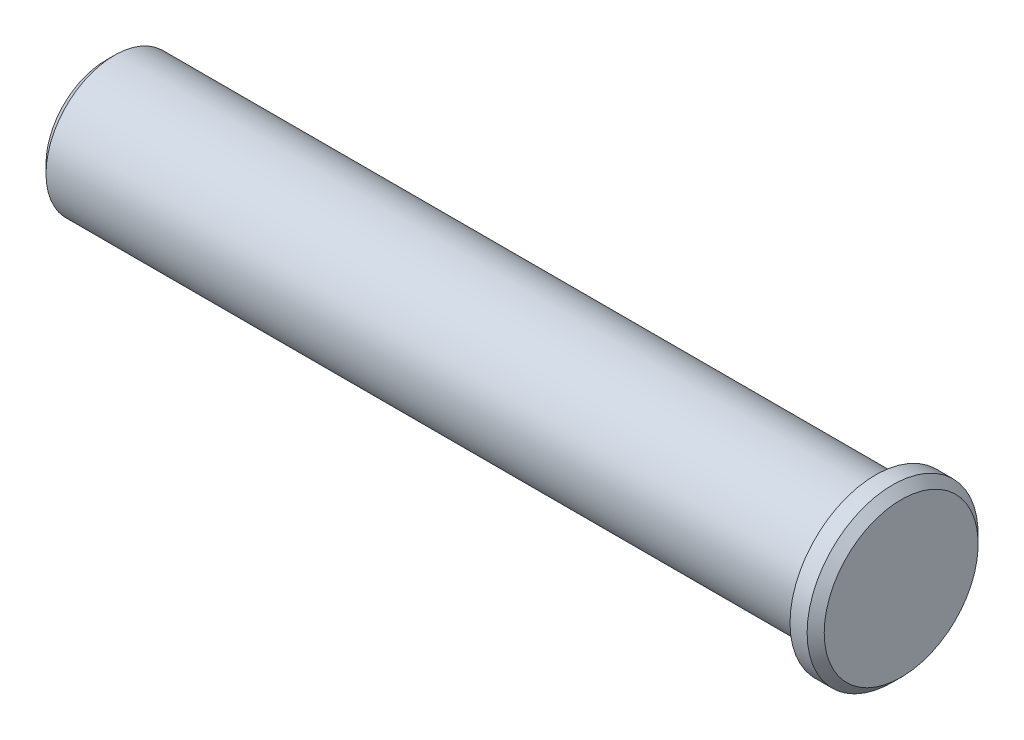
ISO-10303-21;
HEADER;
FILE_DESCRIPTION(('STEP AP214'),'2;1');
FILE_NAME('part.step','',(''),(''),'','','');
FILE_SCHEMA(('AUTOMOTIVE_DESIGN { 1 0 10303 214 1 1 1 1 }'));
ENDSEC;
DATA;
#1=APPLICATION_CONTEXT('core data for automotive mechanical design processes');
#2=APPLICATION_PROTOCOL_DEFINITION('international standard','automotive_design',2000,#1);
#3=PRODUCT_CONTEXT('',#1,'mechanical');
#4=PRODUCT('Part','Part','',(#3));
#5=PRODUCT_RELATED_PRODUCT_CATEGORY('part','',(#4));
#6=PRODUCT_DEFINITION_FORMATION('','',#4);
#7=PRODUCT_DEFINITION_CONTEXT('part definition',#1,'design');
#8=PRODUCT_DEFINITION('design','',#6,#7);
#9=PRODUCT_DEFINITION_SHAPE('','',#8);
#10=(LENGTH_UNIT() NAMED_UNIT(*) SI_UNIT(.MILLI.,.METRE.));
#11=(NAMED_UNIT(*) PLANE_ANGLE_UNIT() SI_UNIT($,.RADIAN.));
#12=(NAMED_UNIT(*) SI_UNIT($,.STERADIAN.) SOLID_ANGLE_UNIT());
#13=UNCERTAINTY_MEASURE_WITH_UNIT(LENGTH_MEASURE(1.E-05),#10,'distance_accuracy_value','');
#14=(GEOMETRIC_REPRESENTATION_CONTEXT(3) GLOBAL_UNCERTAINTY_ASSIGNED_CONTEXT((#13)) GLOBAL_UNIT_ASSIGNED_CONTEXT((#10,
#11,#12)) REPRESENTATION_CONTEXT('',''));
#15=CARTESIAN_POINT('',(0.,0.,0.));
#16=DIRECTION('',(0.,0.,1.));
#17=DIRECTION('',(1.,0.,0.));
#18=AXIS2_PLACEMENT_3D('',#15,#16,#17);
#19=CARTESIAN_POINT('',(-30.06462804,0.,0.));
#20=DIRECTION('',(1.,0.,0.));
#21=DIRECTION('',(0.,0.,-1.));
#22=AXIS2_PLACEMENT_3D('',#19,#20,#21);
#23=CONICAL_SURFACE('',#22,8.,0.785398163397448);
#24=CARTESIAN_POINT('',(-31.06462804,0.,0.));
#25=DIRECTION('',(-1.,0.,0.));
#26=DIRECTION('',(0.,0.,1.));
#27=AXIS2_PLACEMENT_3D('',#24,#25,#26);
#28=CIRCLE('',#27,7.);
#29=CARTESIAN_POINT('',(-31.06462804,0.,7.));
#30=VERTEX_POINT('',#29);
#31=EDGE_CURVE('E10',#30,#30,#28,.T.);
#32=ORIENTED_EDGE('',*,*,#31,.F.);
#33=EDGE_LOOP('',(#32));
#34=FACE_BOUND('',#33,.T.);
#35=CARTESIAN_POINT('',(-30.06462804,0.,0.));
#36=DIRECTION('',(-1.,0.,0.));
#37=DIRECTION('',(0.,0.,1.));
#38=AXIS2_PLACEMENT_3D('',#35,#36,#37);
#39=CIRCLE('',#38,8.);
#40=CARTESIAN_POINT('',(-30.06462804,0.,8.));
#41=VERTEX_POINT('',#40);
#42=EDGE_CURVE('E51',#41,#41,#39,.T.);
#43=ORIENTED_EDGE('',*,*,#42,.T.);
#44=EDGE_LOOP('',(#43));
#45=FACE_BOUND('',#44,.T.);
#46=ADVANCED_FACE('F25',(#34,#45),#23,.T.);
#47=CARTESIAN_POINT('',(-31.06462804,7.,0.));
#48=DIRECTION('',(1.,0.,0.));
#49=DIRECTION('',(0.,0.,-1.));
#50=AXIS2_PLACEMENT_3D('',#47,#48,#49);
#51=PLANE('',#50);
#52=ORIENTED_EDGE('',*,*,#31,.T.);
#53=EDGE_LOOP('',(#52));
#54=FACE_BOUND('',#53,.T.);
#55=ADVANCED_FACE('F76',(#54),#51,.F.);
#56=CARTESIAN_POINT('',(61.93537196,9.,0.));
#57=DIRECTION('',(-1.,0.,0.));
#58=DIRECTION('',(0.,0.,1.));
#59=AXIS2_PLACEMENT_3D('',#56,#57,#58);
#60=PLANE('',#59);
#61=CARTESIAN_POINT('',(61.93537196,0.,0.));
#62=DIRECTION('',(-1.,0.,0.));
#63=DIRECTION('',(0.,0.,1.));
#64=AXIS2_PLACEMENT_3D('',#61,#62,#63);
#65=CIRCLE('',#64,9.);
#66=CARTESIAN_POINT('',(61.93537196,0.,9.));
#67=VERTEX_POINT('',#66);
#68=EDGE_CURVE('E36',#67,#67,#65,.T.);
#69=ORIENTED_EDGE('',*,*,#68,.F.);
#70=EDGE_LOOP('',(#69));
#71=FACE_BOUND('',#70,.T.);
#72=ADVANCED_FACE('F81',(#71),#60,.F.);
#73=CARTESIAN_POINT('',(61.93537196,0.,0.));
#74=DIRECTION('',(-1.,0.,0.));
#75=DIRECTION('',(0.,0.,1.));
#76=AXIS2_PLACEMENT_3D('',#73,#74,#75);
#77=CONICAL_SURFACE('',#76,9.,0.785398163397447);
#78=CARTESIAN_POINT('',(60.93537196,0.,0.));
#79=DIRECTION('',(-1.,0.,0.));
#80=DIRECTION('',(0.,0.,1.));
#81=AXIS2_PLACEMENT_3D('',#78,#79,#80);
#82=CIRCLE('',#81,10.);
#83=CARTESIAN_POINT('',(60.93537196,0.,10.));
#84=VERTEX_POINT('',#83);
#85=EDGE_CURVE('E40',#84,#84,#82,.T.);
#86=ORIENTED_EDGE('',*,*,#85,.F.);
#87=EDGE_LOOP('',(#86));
#88=FACE_BOUND('',#87,.T.);
#89=ORIENTED_EDGE('',*,*,#68,.T.);
#90=EDGE_LOOP('',(#89));
#91=FACE_BOUND('',#90,.T.);
#92=ADVANCED_FACE('F95',(#88,#91),#77,.T.);
#93=CARTESIAN_POINT('',(-36.779071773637,0.,0.));
#94=DIRECTION('',(-1.,0.,0.));
#95=DIRECTION('',(0.,0.,1.));
#96=AXIS2_PLACEMENT_3D('',#93,#94,#95);
#97=CYLINDRICAL_SURFACE('',#96,10.);
#98=CARTESIAN_POINT('',(58.93537196,0.,0.));
#99=DIRECTION('',(-1.,0.,0.));
#100=DIRECTION('',(0.,0.,1.));
#101=AXIS2_PLACEMENT_3D('',#98,#99,#100);
#102=CIRCLE('',#101,10.);
#103=CARTESIAN_POINT('',(58.93537196,0.,10.));
#104=VERTEX_POINT('',#103);
#105=EDGE_CURVE('E45',#104,#104,#102,.T.);
#106=ORIENTED_EDGE('',*,*,#105,.F.);
#107=EDGE_LOOP('',(#106));
#108=FACE_BOUND('',#107,.T.);
#109=ORIENTED_EDGE('',*,*,#85,.T.);
#110=EDGE_LOOP('',(#109));
#111=FACE_BOUND('',#110,.T.);
#112=ADVANCED_FACE('F89',(#108,#111),#97,.T.);
#113=CARTESIAN_POINT('',(58.93537196,10.,0.));
#114=DIRECTION('',(1.,0.,0.));
#115=DIRECTION('',(0.,0.,-1.));
#116=AXIS2_PLACEMENT_3D('',#113,#114,#115);
#117=PLANE('',#116);
#118=CARTESIAN_POINT('',(58.93537196,0.,0.));
#119=DIRECTION('',(-1.,0.,0.));
#120=DIRECTION('',(0.,0.,1.));
#121=AXIS2_PLACEMENT_3D('',#118,#119,#120);
#122=CIRCLE('',#121,8.);
#123=CARTESIAN_POINT('',(58.93537196,0.,8.));
#124=VERTEX_POINT('',#123);
#125=EDGE_CURVE('E48',#124,#124,#122,.T.);
#126=ORIENTED_EDGE('',*,*,#125,.F.);
#127=EDGE_LOOP('',(#126));
#128=FACE_BOUND('',#127,.T.);
#129=ORIENTED_EDGE('',*,*,#105,.T.);
#130=EDGE_LOOP('',(#129));
#131=FACE_BOUND('',#130,.T.);
#132=ADVANCED_FACE('F73',(#128,#131),#117,.F.);
#133=CARTESIAN_POINT('',(-36.779071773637,0.,0.));
#134=DIRECTION('',(-1.,0.,0.));
#135=DIRECTION('',(0.,0.,1.));
#136=AXIS2_PLACEMENT_3D('',#133,#134,#135);
#137=CYLINDRICAL_SURFACE('',#136,8.);
#138=CARTESIAN_POINT('',(-26.9047155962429,0.,-8.));
#139=CARTESIAN_POINT('',(-26.9047183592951,0.0670012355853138,-7.99999892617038));
#140=CARTESIAN_POINT('',(-26.9103459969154,0.134041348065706,-7.99914946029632));
#141=CARTESIAN_POINT('',(-26.9327021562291,0.26624770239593,-7.99584252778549));
#142=CARTESIAN_POINT('',(-26.9494414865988,0.331412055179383,-7.99338349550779));
#143=CARTESIAN_POINT('',(-26.993509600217,0.457934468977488,-7.9871337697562));
#144=CARTESIAN_POINT('',(-27.0208303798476,0.519295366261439,-7.98334408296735));
#145=CARTESIAN_POINT('',(-27.0852662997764,0.636552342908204,-7.97485180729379));
#146=CARTESIAN_POINT('',(-27.1223800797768,0.692449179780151,-7.97014934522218));
#147=CARTESIAN_POINT('',(-27.2056574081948,0.797637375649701,-7.96031336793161));
#148=CARTESIAN_POINT('',(-27.2518823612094,0.8468798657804,-7.95517707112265));
#149=CARTESIAN_POINT('',(-27.351937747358,0.936939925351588,-7.94507408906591));
#150=CARTESIAN_POINT('',(-27.4057686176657,0.977757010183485,-7.94010741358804));
#151=CARTESIAN_POINT('',(-27.5198361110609,1.04999783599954,-7.93087901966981));
#152=CARTESIAN_POINT('',(-27.5801029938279,1.08137429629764,-7.92662089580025));
#153=CARTESIAN_POINT('',(-27.7051258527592,1.13354105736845,-7.91932969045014));
#154=CARTESIAN_POINT('',(-27.769881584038,1.1543319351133,-7.91629654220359));
#155=CARTESIAN_POINT('',(-27.9015300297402,1.18458559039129,-7.91182604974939));
#156=CARTESIAN_POINT('',(-27.9684031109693,1.19413202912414,-7.91037692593));
#157=CARTESIAN_POINT('',(-28.1028165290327,1.20188499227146,-7.90920279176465));
#158=CARTESIAN_POINT('',(-28.1703568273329,1.20009216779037,-7.90947768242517));
#159=CARTESIAN_POINT('',(-28.3035964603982,1.1852858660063,-7.91170974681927));
#160=CARTESIAN_POINT('',(-28.3693064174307,1.172365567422,-7.91365295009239));
#161=CARTESIAN_POINT('',(-28.4976150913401,1.13581693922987,-7.91898086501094));
#162=CARTESIAN_POINT('',(-28.5602137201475,1.1121883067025,-7.92236561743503));
#163=CARTESIAN_POINT('',(-28.6808062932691,1.05479682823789,-7.93021068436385));
#164=CARTESIAN_POINT('',(-28.7387811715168,1.02099451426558,-7.93467517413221));
#165=CARTESIAN_POINT('',(-28.8482712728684,0.944243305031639,-7.94417366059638));
#166=CARTESIAN_POINT('',(-28.8997860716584,0.901293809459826,-7.94920769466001));
#167=CARTESIAN_POINT('',(-28.9954337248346,0.806955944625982,-7.95933978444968));
#168=CARTESIAN_POINT('',(-29.0394875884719,0.755487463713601,-7.96443797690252));
#169=CARTESIAN_POINT('',(-29.1183443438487,0.645845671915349,-7.97407718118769));
#170=CARTESIAN_POINT('',(-29.153147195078,0.587672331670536,-7.97861819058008));
#171=CARTESIAN_POINT('',(-29.2125180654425,0.466203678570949,-7.98663612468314));
#172=CARTESIAN_POINT('',(-29.2370799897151,0.402905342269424,-7.99011241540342));
#173=CARTESIAN_POINT('',(-29.2752031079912,0.273018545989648,-7.99560392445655));
#174=CARTESIAN_POINT('',(-29.2887650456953,0.206430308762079,-7.99761924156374));
#175=CARTESIAN_POINT('',(-29.3043981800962,0.0725356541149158,-7.99994864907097));
#176=CARTESIAN_POINT('',(-29.3065779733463,0.00524218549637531,-8.0002788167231));
#177=CARTESIAN_POINT('',(-29.299673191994,-0.128749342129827,-7.99924448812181));
#178=CARTESIAN_POINT('',(-29.2905889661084,-0.195447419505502,-7.99788004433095));
#179=CARTESIAN_POINT('',(-29.2615043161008,-0.326025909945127,-7.99361974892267));
#180=CARTESIAN_POINT('',(-29.2415567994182,-0.389918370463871,-7.99073132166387));
#181=CARTESIAN_POINT('',(-29.1913675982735,-0.5134519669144,-7.98374588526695));
#182=CARTESIAN_POINT('',(-29.161125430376,-0.57309290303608,-7.97964881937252));
#183=CARTESIAN_POINT('',(-29.0909506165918,-0.686907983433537,-7.97066145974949));
#184=CARTESIAN_POINT('',(-29.0509490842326,-0.741039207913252,-7.96576561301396));
#185=CARTESIAN_POINT('',(-28.9624869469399,-0.841858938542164,-7.95574290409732));
#186=CARTESIAN_POINT('',(-28.9140258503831,-0.888547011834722,-7.95061602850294));
#187=CARTESIAN_POINT('',(-28.8095367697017,-0.973550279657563,-7.94065811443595));
#188=CARTESIAN_POINT('',(-28.7534492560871,-1.01179267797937,-7.93582988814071));
#189=CARTESIAN_POINT('',(-28.6355827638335,-1.07831303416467,-7.92706575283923));
#190=CARTESIAN_POINT('',(-28.5738039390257,-1.10659126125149,-7.92312981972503));
#191=CARTESIAN_POINT('',(-28.4465255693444,-1.15226773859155,-7.91661626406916));
#192=CARTESIAN_POINT('',(-28.3810400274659,-1.16970429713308,-7.9140338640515));
#193=CARTESIAN_POINT('',(-28.2480283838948,-1.19332439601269,-7.91050705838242));
#194=CARTESIAN_POINT('',(-28.1805024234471,-1.19950871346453,-7.90956253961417));
#195=CARTESIAN_POINT('',(-28.0460523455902,-1.20043029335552,-7.90942266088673));
#196=CARTESIAN_POINT('',(-27.9791290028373,-1.1952820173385,-7.91020981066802));
#197=CARTESIAN_POINT('',(-27.847111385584,-1.17392983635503,-7.91340656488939));
#198=CARTESIAN_POINT('',(-27.7820171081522,-1.15772594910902,-7.91581616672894));
#199=CARTESIAN_POINT('',(-27.6555371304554,-1.11476298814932,-7.92198020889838));
#200=CARTESIAN_POINT('',(-27.5941486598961,-1.08801191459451,-7.9257336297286));
#201=CARTESIAN_POINT('',(-27.4767126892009,-1.02472534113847,-7.93416363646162));
#202=CARTESIAN_POINT('',(-27.4206653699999,-0.988189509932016,-7.93884025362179));
#203=CARTESIAN_POINT('',(-27.3149211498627,-0.905954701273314,-7.9486459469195));
#204=CARTESIAN_POINT('',(-27.2652905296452,-0.860170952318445,-7.95377894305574));
#205=CARTESIAN_POINT('',(-27.1743759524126,-0.760919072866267,-7.96388631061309));
#206=CARTESIAN_POINT('',(-27.1330939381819,-0.707449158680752,-7.96886064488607));
#207=CARTESIAN_POINT('',(-27.059845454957,-0.593996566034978,-7.97812148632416));
#208=CARTESIAN_POINT('',(-27.0279315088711,-0.53397966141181,-7.98240405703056));
#209=CARTESIAN_POINT('',(-26.9746847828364,-0.409401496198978,-7.98976023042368));
#210=CARTESIAN_POINT('',(-26.9533410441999,-0.344845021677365,-7.99283508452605));
#211=CARTESIAN_POINT('',(-26.9266825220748,-0.233332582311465,-7.99672751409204));
#212=CARTESIAN_POINT('',(-26.9184575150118,-0.187064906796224,-7.99794839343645));
#213=CARTESIAN_POINT('',(-26.9074731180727,-0.0938711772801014,-7.99958500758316));
#214=CARTESIAN_POINT('',(-26.9047136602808,-0.0469451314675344,-8.0000007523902));
#215=CARTESIAN_POINT('',(-26.9047155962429,0.,-8.));
#216=B_SPLINE_CURVE_WITH_KNOTS('',3,(#138,#139,#140,#141,#142,#143,#144,#145,#146,#147,#148,
#149,#150,#151,#152,#153,#154,#155,#156,#157,#158,#159,#160,#161,#162,#163,#164,#165,#166,#167,
#168,#169,#170,#171,#172,#173,#174,#175,#176,#177,#178,#179,#180,#181,#182,#183,#184,#185,#186,
#187,#188,#189,#190,#191,#192,#193,#194,#195,#196,#197,#198,#199,#200,#201,#202,#203,#204,#205,
#206,#207,#208,#209,#210,#211,#212,#213,#214,#215),.UNSPECIFIED.,.T.,.F.,(4,2,2,2,2,2,2,2,2,2,2,
2,2,2,2,2,2,2,2,2,2,2,2,2,2,2,2,2,2,2,2,2,2,2,2,2,2,2,4),(0.,0.200832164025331,0.40185997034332,
0.60273601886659,0.80358417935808,1.00583532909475,1.20809810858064,1.411357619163,
1.61460604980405,1.8163325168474,2.01804740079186,2.21808941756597,2.41813709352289,
2.61897106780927,2.81981822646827,3.02267433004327,3.22553132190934,3.428508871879,
3.63147269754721,3.83249646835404,4.03351401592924,4.23356119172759,4.43361776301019,
4.63512950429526,4.83665296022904,5.03985093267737,5.24304341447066,5.44551378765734,
5.64797017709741,5.84839110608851,6.04881171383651,6.24908059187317,6.44935625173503,
6.65155863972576,6.85380802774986,7.05717058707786,7.26032186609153,7.40103881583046,
7.54175401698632),.UNSPECIFIED.);
#217=CARTESIAN_POINT('',(-26.9047155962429,0.,-8.));
#218=VERTEX_POINT('',#217);
#219=EDGE_CURVE('E28',#218,#218,#216,.T.);
#220=ORIENTED_EDGE('',*,*,#219,.T.);
#221=EDGE_LOOP('',(#220));
#222=FACE_BOUND('',#221,.T.);
#223=ORIENTED_EDGE('',*,*,#42,.F.);
#224=EDGE_LOOP('',(#223));
#225=FACE_BOUND('',#224,.T.);
#226=ORIENTED_EDGE('',*,*,#125,.T.);
#227=EDGE_LOOP('',(#226));
#228=FACE_BOUND('',#227,.T.);
#229=ADVANCED_FACE('F61',(#222,#225,#228),#137,.T.);
#230=CARTESIAN_POINT('',(-28.1047155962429,0.,-10.));
#231=DIRECTION('',(0.,0.,1.));
#232=DIRECTION('',(1.,0.,0.));
#233=AXIS2_PLACEMENT_3D('',#230,#231,#232);
#234=CYLINDRICAL_SURFACE('',#233,1.2);
#235=CARTESIAN_POINT('',(-28.1047155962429,0.,0.));
#236=DIRECTION('',(0.,0.,1.));
#237=DIRECTION('',(1.,0.,0.));
#238=AXIS2_PLACEMENT_3D('',#235,#236,#237);
#239=CIRCLE('',#238,1.2);
#240=CARTESIAN_POINT('',(-26.9047155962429,0.,0.));
#241=VERTEX_POINT('',#240);
#242=EDGE_CURVE('E54',#241,#241,#239,.T.);
#243=ORIENTED_EDGE('',*,*,#242,.T.);
#244=EDGE_LOOP('',(#243));
#245=FACE_BOUND('',#244,.T.);
#246=ORIENTED_EDGE('',*,*,#219,.F.);
#247=EDGE_LOOP('',(#246));
#248=FACE_BOUND('',#247,.T.);
#249=ADVANCED_FACE('F64',(#245,#248),#234,.F.);
#250=CARTESIAN_POINT('',(-28.1047155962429,0.,0.));
#251=DIRECTION('',(0.,0.,1.));
#252=DIRECTION('',(1.,0.,0.));
#253=AXIS2_PLACEMENT_3D('',#250,#251,#252);
#254=PLANE('',#253);
#255=ORIENTED_EDGE('',*,*,#242,.F.);
#256=EDGE_LOOP('',(#255));
#257=FACE_BOUND('',#256,.T.);
#258=ADVANCED_FACE('F66',(#257),#254,.F.);
#259=CLOSED_SHELL('',(#46,#55,#72,#92,#112,#132,#229,#249,#258));
#260=MANIFOLD_SOLID_BREP('B2',#259);
#261=ADVANCED_BREP_SHAPE_REPRESENTATION('',(#18,#260),#14);
#262=SHAPE_DEFINITION_REPRESENTATION(#9,#261);
ENDSEC;
END-ISO-10303-21;
